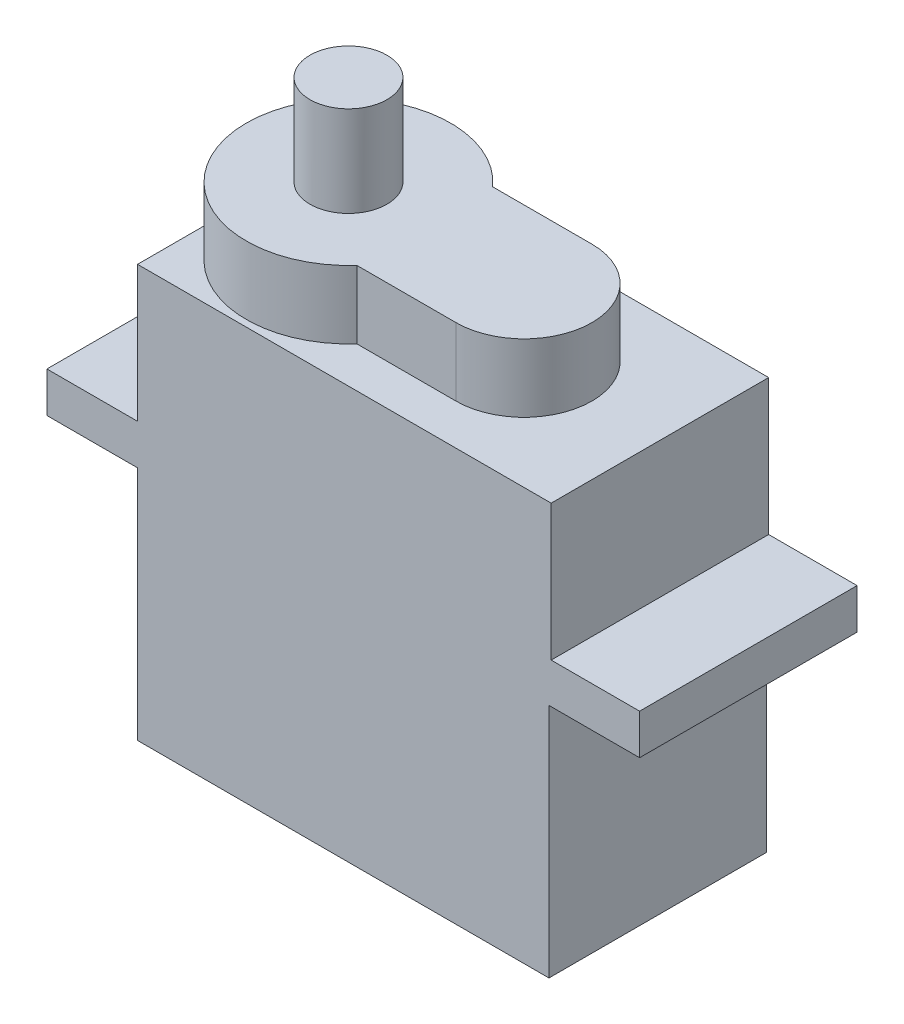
ISO-10303-21;
HEADER;
FILE_DESCRIPTION(('STEP AP214'),'2;1');
FILE_NAME('part.step','',(''),(''),'','','');
FILE_SCHEMA(('AUTOMOTIVE_DESIGN { 1 0 10303 214 1 1 1 1 }'));
ENDSEC;
DATA;
#1=APPLICATION_CONTEXT('core data for automotive mechanical design processes');
#2=APPLICATION_PROTOCOL_DEFINITION('international standard','automotive_design',2000,#1);
#3=PRODUCT_CONTEXT('',#1,'mechanical');
#4=PRODUCT('Part','Part','',(#3));
#5=PRODUCT_RELATED_PRODUCT_CATEGORY('part','',(#4));
#6=PRODUCT_DEFINITION_FORMATION('','',#4);
#7=PRODUCT_DEFINITION_CONTEXT('part definition',#1,'design');
#8=PRODUCT_DEFINITION('design','',#6,#7);
#9=PRODUCT_DEFINITION_SHAPE('','',#8);
#10=(LENGTH_UNIT() NAMED_UNIT(*) SI_UNIT(.MILLI.,.METRE.));
#11=(NAMED_UNIT(*) PLANE_ANGLE_UNIT() SI_UNIT($,.RADIAN.));
#12=(NAMED_UNIT(*) SI_UNIT($,.STERADIAN.) SOLID_ANGLE_UNIT());
#13=UNCERTAINTY_MEASURE_WITH_UNIT(LENGTH_MEASURE(1.E-05),#10,'distance_accuracy_value','');
#14=(GEOMETRIC_REPRESENTATION_CONTEXT(3) GLOBAL_UNCERTAINTY_ASSIGNED_CONTEXT((#13)) GLOBAL_UNIT_ASSIGNED_CONTEXT((#10,
#11,#12)) REPRESENTATION_CONTEXT('',''));
#15=CARTESIAN_POINT('',(0.,0.,0.));
#16=DIRECTION('',(0.,0.,1.));
#17=DIRECTION('',(1.,0.,0.));
#18=AXIS2_PLACEMENT_3D('',#15,#16,#17);
#19=CARTESIAN_POINT('',(-11.5316,9.8806,12.192));
#20=DIRECTION('',(0.,-1.,0.));
#21=DIRECTION('',(0.,0.,-1.));
#22=AXIS2_PLACEMENT_3D('',#19,#20,#21);
#23=PLANE('',#22);
#24=DIRECTION('',(1.,0.,0.));
#25=VECTOR('',#24,1.);
#26=CARTESIAN_POINT('',(4.0347347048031,9.8806,9.906));
#27=LINE('',#26,#25);
#28=CARTESIAN_POINT('',(-1.52716675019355,9.8806,9.906));
#29=VERTEX_POINT('',#28);
#30=CARTESIAN_POINT('',(4.0347347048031,9.8806,9.906));
#31=VERTEX_POINT('',#30);
#32=EDGE_CURVE('E51',#29,#31,#27,.T.);
#33=ORIENTED_EDGE('',*,*,#32,.F.);
#34=CARTESIAN_POINT('',(-5.8039,9.8806,6.096));
#35=DIRECTION('',(0.,1.,0.));
#36=DIRECTION('',(0.,0.,1.));
#37=AXIS2_PLACEMENT_3D('',#34,#35,#36);
#38=CIRCLE('',#37,5.7277);
#39=CARTESIAN_POINT('',(-11.5316,9.8806,6.096));
#40=VERTEX_POINT('',#39);
#41=EDGE_CURVE('E44',#40,#29,#38,.T.);
#42=ORIENTED_EDGE('',*,*,#41,.F.);
#43=DIRECTION('',(0.,0.,-1.));
#44=VECTOR('',#43,1.);
#45=CARTESIAN_POINT('',(-11.5316,9.8806,12.192));
#46=LINE('',#45,#44);
#47=CARTESIAN_POINT('',(-11.5316,9.8806,12.192));
#48=VERTEX_POINT('',#47);
#49=EDGE_CURVE('E229',#48,#40,#46,.T.);
#50=ORIENTED_EDGE('',*,*,#49,.F.);
#51=DIRECTION('',(-1.,0.,0.));
#52=VECTOR('',#51,1.);
#53=CARTESIAN_POINT('',(-11.5316,9.8806,12.192));
#54=LINE('',#53,#52);
#55=CARTESIAN_POINT('',(11.6547347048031,9.8806,12.192));
#56=VERTEX_POINT('',#55);
#57=EDGE_CURVE('E205',#56,#48,#54,.T.);
#58=ORIENTED_EDGE('',*,*,#57,.F.);
#59=DIRECTION('',(0.,0.,-1.));
#60=VECTOR('',#59,1.);
#61=CARTESIAN_POINT('',(11.6547347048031,9.8806,12.192));
#62=LINE('',#61,#60);
#63=CARTESIAN_POINT('',(11.6547347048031,9.8806,0.));
#64=VERTEX_POINT('',#63);
#65=EDGE_CURVE('E232',#56,#64,#62,.T.);
#66=ORIENTED_EDGE('',*,*,#65,.T.);
#67=DIRECTION('',(-1.,0.,0.));
#68=VECTOR('',#67,1.);
#69=CARTESIAN_POINT('',(-11.5316,9.8806,0.));
#70=LINE('',#69,#68);
#71=CARTESIAN_POINT('',(-11.5316,9.8806,0.));
#72=VERTEX_POINT('',#71);
#73=EDGE_CURVE('E185',#64,#72,#70,.T.);
#74=ORIENTED_EDGE('',*,*,#73,.T.);
#75=EDGE_CURVE('E206',#40,#72,#46,.T.);
#76=ORIENTED_EDGE('',*,*,#75,.F.);
#77=CARTESIAN_POINT('',(-1.52716675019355,9.8806,2.286));
#78=VERTEX_POINT('',#77);
#79=EDGE_CURVE('E266',#78,#40,#38,.T.);
#80=ORIENTED_EDGE('',*,*,#79,.F.);
#81=DIRECTION('',(-1.,0.,0.));
#82=VECTOR('',#81,1.);
#83=CARTESIAN_POINT('',(4.0347347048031,9.8806,2.286));
#84=LINE('',#83,#82);
#85=CARTESIAN_POINT('',(4.0347347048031,9.8806,2.286));
#86=VERTEX_POINT('',#85);
#87=EDGE_CURVE('E273',#86,#78,#84,.T.);
#88=ORIENTED_EDGE('',*,*,#87,.F.);
#89=CARTESIAN_POINT('',(4.0347347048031,9.8806,6.096));
#90=DIRECTION('',(0.,1.,0.));
#91=DIRECTION('',(0.,0.,-1.));
#92=AXIS2_PLACEMENT_3D('',#89,#90,#91);
#93=CIRCLE('',#92,3.81);
#94=EDGE_CURVE('E56',#31,#86,#93,.T.);
#95=ORIENTED_EDGE('',*,*,#94,.F.);
#96=EDGE_LOOP('',(#33,#42,#50,#58,#66,#74,#76,#80,#88,#95));
#97=FACE_BOUND('',#96,.T.);
#98=ADVANCED_FACE('F36',(#97),#23,.F.);
#99=CARTESIAN_POINT('',(-11.5316,2.2606,12.192));
#100=DIRECTION('',(1.,0.,0.));
#101=DIRECTION('',(0.,0.,-1.));
#102=AXIS2_PLACEMENT_3D('',#99,#100,#101);
#103=PLANE('',#102);
#104=DIRECTION('',(0.,-1.,0.));
#105=VECTOR('',#104,1.);
#106=CARTESIAN_POINT('',(-11.5316,2.2606,0.));
#107=LINE('',#106,#105);
#108=CARTESIAN_POINT('',(-11.5316,2.2606,0.));
#109=VERTEX_POINT('',#108);
#110=EDGE_CURVE('E172',#72,#109,#107,.T.);
#111=ORIENTED_EDGE('',*,*,#110,.T.);
#112=DIRECTION('',(0.,0.,-1.));
#113=VECTOR('',#112,1.);
#114=CARTESIAN_POINT('',(-11.5316,2.2606,12.192));
#115=LINE('',#114,#113);
#116=CARTESIAN_POINT('',(-11.5316,2.2606,12.192));
#117=VERTEX_POINT('',#116);
#118=EDGE_CURVE('E261',#117,#109,#115,.T.);
#119=ORIENTED_EDGE('',*,*,#118,.F.);
#120=DIRECTION('',(0.,-1.,0.));
#121=VECTOR('',#120,1.);
#122=CARTESIAN_POINT('',(-11.5316,2.2606,12.192));
#123=LINE('',#122,#121);
#124=EDGE_CURVE('E181',#48,#117,#123,.T.);
#125=ORIENTED_EDGE('',*,*,#124,.F.);
#126=ORIENTED_EDGE('',*,*,#49,.T.);
#127=ORIENTED_EDGE('',*,*,#75,.T.);
#128=EDGE_LOOP('',(#111,#119,#125,#126,#127));
#129=FACE_BOUND('',#128,.T.);
#130=ADVANCED_FACE('F38',(#129),#103,.F.);
#131=CARTESIAN_POINT('',(-16.6116,2.2606,12.192));
#132=DIRECTION('',(0.,-1.,0.));
#133=DIRECTION('',(1.,0.,0.));
#134=AXIS2_PLACEMENT_3D('',#131,#132,#133);
#135=PLANE('',#134);
#136=DIRECTION('',(-1.,0.,0.));
#137=VECTOR('',#136,1.);
#138=CARTESIAN_POINT('',(-16.6116,2.2606,0.));
#139=LINE('',#138,#137);
#140=CARTESIAN_POINT('',(-16.6116,2.2606,0.));
#141=VERTEX_POINT('',#140);
#142=EDGE_CURVE('E175',#109,#141,#139,.T.);
#143=ORIENTED_EDGE('',*,*,#142,.T.);
#144=DIRECTION('',(0.,0.,-1.));
#145=VECTOR('',#144,1.);
#146=CARTESIAN_POINT('',(-16.6116,2.2606,12.192));
#147=LINE('',#146,#145);
#148=CARTESIAN_POINT('',(-16.6116,2.2606,12.192));
#149=VERTEX_POINT('',#148);
#150=EDGE_CURVE('E259',#149,#141,#147,.T.);
#151=ORIENTED_EDGE('',*,*,#150,.F.);
#152=DIRECTION('',(-1.,0.,0.));
#153=VECTOR('',#152,1.);
#154=CARTESIAN_POINT('',(-16.6116,2.2606,12.192));
#155=LINE('',#154,#153);
#156=EDGE_CURVE('E184',#117,#149,#155,.T.);
#157=ORIENTED_EDGE('',*,*,#156,.F.);
#158=ORIENTED_EDGE('',*,*,#118,.T.);
#159=EDGE_LOOP('',(#143,#151,#157,#158));
#160=FACE_BOUND('',#159,.T.);
#161=ADVANCED_FACE('F305',(#160),#135,.F.);
#162=CARTESIAN_POINT('',(-16.6116,0.,12.192));
#163=DIRECTION('',(1.,0.,0.));
#164=DIRECTION('',(0.,0.,-1.));
#165=AXIS2_PLACEMENT_3D('',#162,#163,#164);
#166=PLANE('',#165);
#167=DIRECTION('',(0.,-1.,0.));
#168=VECTOR('',#167,1.);
#169=CARTESIAN_POINT('',(-16.6116,0.,0.));
#170=LINE('',#169,#168);
#171=CARTESIAN_POINT('',(-16.6116,0.,0.));
#172=VERTEX_POINT('',#171);
#173=EDGE_CURVE('E209',#141,#172,#170,.T.);
#174=ORIENTED_EDGE('',*,*,#173,.T.);
#175=DIRECTION('',(0.,0.,-1.));
#176=VECTOR('',#175,1.);
#177=CARTESIAN_POINT('',(-16.6116,0.,12.192));
#178=LINE('',#177,#176);
#179=CARTESIAN_POINT('',(-16.6116,0.,12.192));
#180=VERTEX_POINT('',#179);
#181=EDGE_CURVE('E256',#180,#172,#178,.T.);
#182=ORIENTED_EDGE('',*,*,#181,.F.);
#183=DIRECTION('',(0.,-1.,0.));
#184=VECTOR('',#183,1.);
#185=CARTESIAN_POINT('',(-16.6116,0.,12.192));
#186=LINE('',#185,#184);
#187=EDGE_CURVE('E187',#149,#180,#186,.T.);
#188=ORIENTED_EDGE('',*,*,#187,.F.);
#189=ORIENTED_EDGE('',*,*,#150,.T.);
#190=EDGE_LOOP('',(#174,#182,#188,#189));
#191=FACE_BOUND('',#190,.T.);
#192=ADVANCED_FACE('F343',(#191),#166,.F.);
#193=CARTESIAN_POINT('',(-11.5316,0.,12.192));
#194=DIRECTION('',(0.,1.,0.));
#195=DIRECTION('',(-1.,0.,0.));
#196=AXIS2_PLACEMENT_3D('',#193,#194,#195);
#197=PLANE('',#196);
#198=DIRECTION('',(1.,0.,0.));
#199=VECTOR('',#198,1.);
#200=CARTESIAN_POINT('',(-11.5316,0.,0.));
#201=LINE('',#200,#199);
#202=CARTESIAN_POINT('',(-11.5316,0.,0.));
#203=VERTEX_POINT('',#202);
#204=EDGE_CURVE('E211',#172,#203,#201,.T.);
#205=ORIENTED_EDGE('',*,*,#204,.T.);
#206=DIRECTION('',(0.,0.,-1.));
#207=VECTOR('',#206,1.);
#208=CARTESIAN_POINT('',(-11.5316,0.,12.192));
#209=LINE('',#208,#207);
#210=CARTESIAN_POINT('',(-11.5316,0.,12.192));
#211=VERTEX_POINT('',#210);
#212=EDGE_CURVE('E253',#211,#203,#209,.T.);
#213=ORIENTED_EDGE('',*,*,#212,.F.);
#214=DIRECTION('',(1.,0.,0.));
#215=VECTOR('',#214,1.);
#216=CARTESIAN_POINT('',(-11.5316,0.,12.192));
#217=LINE('',#216,#215);
#218=EDGE_CURVE('E189',#180,#211,#217,.T.);
#219=ORIENTED_EDGE('',*,*,#218,.F.);
#220=ORIENTED_EDGE('',*,*,#181,.T.);
#221=EDGE_LOOP('',(#205,#213,#219,#220));
#222=FACE_BOUND('',#221,.T.);
#223=ADVANCED_FACE('F339',(#222),#197,.F.);
#224=CARTESIAN_POINT('',(-11.5316,-13.2334,12.192));
#225=DIRECTION('',(1.,0.,0.));
#226=DIRECTION('',(0.,1.,0.));
#227=AXIS2_PLACEMENT_3D('',#224,#225,#226);
#228=PLANE('',#227);
#229=DIRECTION('',(0.,-1.,0.));
#230=VECTOR('',#229,1.);
#231=CARTESIAN_POINT('',(-11.5316,-13.2334,0.));
#232=LINE('',#231,#230);
#233=CARTESIAN_POINT('',(-11.5316,-13.2334,0.));
#234=VERTEX_POINT('',#233);
#235=EDGE_CURVE('E213',#203,#234,#232,.T.);
#236=ORIENTED_EDGE('',*,*,#235,.T.);
#237=DIRECTION('',(0.,0.,-1.));
#238=VECTOR('',#237,1.);
#239=CARTESIAN_POINT('',(-11.5316,-13.2334,12.192));
#240=LINE('',#239,#238);
#241=CARTESIAN_POINT('',(-11.5316,-13.2334,12.192));
#242=VERTEX_POINT('',#241);
#243=EDGE_CURVE('E250',#242,#234,#240,.T.);
#244=ORIENTED_EDGE('',*,*,#243,.F.);
#245=DIRECTION('',(0.,-1.,0.));
#246=VECTOR('',#245,1.);
#247=CARTESIAN_POINT('',(-11.5316,-13.2334,12.192));
#248=LINE('',#247,#246);
#249=EDGE_CURVE('E191',#211,#242,#248,.T.);
#250=ORIENTED_EDGE('',*,*,#249,.F.);
#251=ORIENTED_EDGE('',*,*,#212,.T.);
#252=EDGE_LOOP('',(#236,#244,#250,#251));
#253=FACE_BOUND('',#252,.T.);
#254=ADVANCED_FACE('F335',(#253),#228,.F.);
#255=CARTESIAN_POINT('',(11.5316,-13.2334,12.192));
#256=DIRECTION('',(0.,1.,0.));
#257=DIRECTION('',(-1.,0.,0.));
#258=AXIS2_PLACEMENT_3D('',#255,#256,#257);
#259=PLANE('',#258);
#260=DIRECTION('',(1.,0.,0.));
#261=VECTOR('',#260,1.);
#262=CARTESIAN_POINT('',(11.5316,-13.2334,0.));
#263=LINE('',#262,#261);
#264=CARTESIAN_POINT('',(11.5316,-13.2334,0.));
#265=VERTEX_POINT('',#264);
#266=EDGE_CURVE('E215',#234,#265,#263,.T.);
#267=ORIENTED_EDGE('',*,*,#266,.T.);
#268=DIRECTION('',(0.,0.,-1.));
#269=VECTOR('',#268,1.);
#270=CARTESIAN_POINT('',(11.5316,-13.2334,12.192));
#271=LINE('',#270,#269);
#272=CARTESIAN_POINT('',(11.5316,-13.2334,12.192));
#273=VERTEX_POINT('',#272);
#274=EDGE_CURVE('E247',#273,#265,#271,.T.);
#275=ORIENTED_EDGE('',*,*,#274,.F.);
#276=DIRECTION('',(1.,0.,0.));
#277=VECTOR('',#276,1.);
#278=CARTESIAN_POINT('',(11.5316,-13.2334,12.192));
#279=LINE('',#278,#277);
#280=EDGE_CURVE('E193',#242,#273,#279,.T.);
#281=ORIENTED_EDGE('',*,*,#280,.F.);
#282=ORIENTED_EDGE('',*,*,#243,.T.);
#283=EDGE_LOOP('',(#267,#275,#281,#282));
#284=FACE_BOUND('',#283,.T.);
#285=ADVANCED_FACE('F331',(#284),#259,.F.);
#286=CARTESIAN_POINT('',(11.5316,0.,12.192));
#287=DIRECTION('',(-1.,0.,0.));
#288=DIRECTION('',(0.,0.,1.));
#289=AXIS2_PLACEMENT_3D('',#286,#287,#288);
#290=PLANE('',#289);
#291=DIRECTION('',(0.,1.,0.));
#292=VECTOR('',#291,1.);
#293=CARTESIAN_POINT('',(11.5316,0.,0.));
#294=LINE('',#293,#292);
#295=CARTESIAN_POINT('',(11.5316,0.,0.));
#296=VERTEX_POINT('',#295);
#297=EDGE_CURVE('E217',#265,#296,#294,.T.);
#298=ORIENTED_EDGE('',*,*,#297,.T.);
#299=DIRECTION('',(0.,0.,-1.));
#300=VECTOR('',#299,1.);
#301=CARTESIAN_POINT('',(11.5316,0.,12.192));
#302=LINE('',#301,#300);
#303=CARTESIAN_POINT('',(11.5316,0.,12.192));
#304=VERTEX_POINT('',#303);
#305=EDGE_CURVE('E244',#304,#296,#302,.T.);
#306=ORIENTED_EDGE('',*,*,#305,.F.);
#307=DIRECTION('',(0.,1.,0.));
#308=VECTOR('',#307,1.);
#309=CARTESIAN_POINT('',(11.5316,0.,12.192));
#310=LINE('',#309,#308);
#311=EDGE_CURVE('E195',#273,#304,#310,.T.);
#312=ORIENTED_EDGE('',*,*,#311,.F.);
#313=ORIENTED_EDGE('',*,*,#274,.T.);
#314=EDGE_LOOP('',(#298,#306,#312,#313));
#315=FACE_BOUND('',#314,.T.);
#316=ADVANCED_FACE('F327',(#315),#290,.F.);
#317=CARTESIAN_POINT('',(16.6116,0.,12.192));
#318=DIRECTION('',(0.,1.,0.));
#319=DIRECTION('',(-1.,0.,0.));
#320=AXIS2_PLACEMENT_3D('',#317,#318,#319);
#321=PLANE('',#320);
#322=DIRECTION('',(1.,0.,0.));
#323=VECTOR('',#322,1.);
#324=CARTESIAN_POINT('',(16.6116,0.,0.));
#325=LINE('',#324,#323);
#326=CARTESIAN_POINT('',(16.6116,0.,0.));
#327=VERTEX_POINT('',#326);
#328=EDGE_CURVE('E219',#296,#327,#325,.T.);
#329=ORIENTED_EDGE('',*,*,#328,.T.);
#330=DIRECTION('',(0.,0.,-1.));
#331=VECTOR('',#330,1.);
#332=CARTESIAN_POINT('',(16.6116,0.,12.192));
#333=LINE('',#332,#331);
#334=CARTESIAN_POINT('',(16.6116,0.,12.192));
#335=VERTEX_POINT('',#334);
#336=EDGE_CURVE('E241',#335,#327,#333,.T.);
#337=ORIENTED_EDGE('',*,*,#336,.F.);
#338=DIRECTION('',(1.,0.,0.));
#339=VECTOR('',#338,1.);
#340=CARTESIAN_POINT('',(16.6116,0.,12.192));
#341=LINE('',#340,#339);
#342=EDGE_CURVE('E197',#304,#335,#341,.T.);
#343=ORIENTED_EDGE('',*,*,#342,.F.);
#344=ORIENTED_EDGE('',*,*,#305,.T.);
#345=EDGE_LOOP('',(#329,#337,#343,#344));
#346=FACE_BOUND('',#345,.T.);
#347=ADVANCED_FACE('F323',(#346),#321,.F.);
#348=CARTESIAN_POINT('',(16.6116,2.2606,12.192));
#349=DIRECTION('',(-1.,0.,0.));
#350=DIRECTION('',(0.,0.,1.));
#351=AXIS2_PLACEMENT_3D('',#348,#349,#350);
#352=PLANE('',#351);
#353=DIRECTION('',(0.,1.,0.));
#354=VECTOR('',#353,1.);
#355=CARTESIAN_POINT('',(16.6116,2.2606,0.));
#356=LINE('',#355,#354);
#357=CARTESIAN_POINT('',(16.6116,2.2606,0.));
#358=VERTEX_POINT('',#357);
#359=EDGE_CURVE('E221',#327,#358,#356,.T.);
#360=ORIENTED_EDGE('',*,*,#359,.T.);
#361=DIRECTION('',(0.,0.,-1.));
#362=VECTOR('',#361,1.);
#363=CARTESIAN_POINT('',(16.6116,2.2606,12.192));
#364=LINE('',#363,#362);
#365=CARTESIAN_POINT('',(16.6116,2.2606,12.192));
#366=VERTEX_POINT('',#365);
#367=EDGE_CURVE('E238',#366,#358,#364,.T.);
#368=ORIENTED_EDGE('',*,*,#367,.F.);
#369=DIRECTION('',(0.,1.,0.));
#370=VECTOR('',#369,1.);
#371=CARTESIAN_POINT('',(16.6116,2.2606,12.192));
#372=LINE('',#371,#370);
#373=EDGE_CURVE('E199',#335,#366,#372,.T.);
#374=ORIENTED_EDGE('',*,*,#373,.F.);
#375=ORIENTED_EDGE('',*,*,#336,.T.);
#376=EDGE_LOOP('',(#360,#368,#374,#375));
#377=FACE_BOUND('',#376,.T.);
#378=ADVANCED_FACE('F319',(#377),#352,.F.);
#379=CARTESIAN_POINT('',(11.6547347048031,2.2606,12.192));
#380=DIRECTION('',(0.,-1.,0.));
#381=DIRECTION('',(1.,0.,0.));
#382=AXIS2_PLACEMENT_3D('',#379,#380,#381);
#383=PLANE('',#382);
#384=DIRECTION('',(-1.,0.,0.));
#385=VECTOR('',#384,1.);
#386=CARTESIAN_POINT('',(11.6547347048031,2.2606,0.));
#387=LINE('',#386,#385);
#388=CARTESIAN_POINT('',(11.6547347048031,2.2606,0.));
#389=VERTEX_POINT('',#388);
#390=EDGE_CURVE('E223',#358,#389,#387,.T.);
#391=ORIENTED_EDGE('',*,*,#390,.T.);
#392=DIRECTION('',(0.,0.,-1.));
#393=VECTOR('',#392,1.);
#394=CARTESIAN_POINT('',(11.6547347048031,2.2606,12.192));
#395=LINE('',#394,#393);
#396=CARTESIAN_POINT('',(11.6547347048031,2.2606,12.192));
#397=VERTEX_POINT('',#396);
#398=EDGE_CURVE('E235',#397,#389,#395,.T.);
#399=ORIENTED_EDGE('',*,*,#398,.F.);
#400=DIRECTION('',(-1.,0.,0.));
#401=VECTOR('',#400,1.);
#402=CARTESIAN_POINT('',(11.6547347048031,2.2606,12.192));
#403=LINE('',#402,#401);
#404=EDGE_CURVE('E201',#366,#397,#403,.T.);
#405=ORIENTED_EDGE('',*,*,#404,.F.);
#406=ORIENTED_EDGE('',*,*,#367,.T.);
#407=EDGE_LOOP('',(#391,#399,#405,#406));
#408=FACE_BOUND('',#407,.T.);
#409=ADVANCED_FACE('F315',(#408),#383,.F.);
#410=CARTESIAN_POINT('',(11.6547347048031,9.8806,12.192));
#411=DIRECTION('',(-1.,0.,0.));
#412=DIRECTION('',(0.,-1.,0.));
#413=AXIS2_PLACEMENT_3D('',#410,#411,#412);
#414=PLANE('',#413);
#415=DIRECTION('',(0.,1.,0.));
#416=VECTOR('',#415,1.);
#417=CARTESIAN_POINT('',(11.6547347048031,9.8806,0.));
#418=LINE('',#417,#416);
#419=EDGE_CURVE('E225',#389,#64,#418,.T.);
#420=ORIENTED_EDGE('',*,*,#419,.T.);
#421=ORIENTED_EDGE('',*,*,#65,.F.);
#422=DIRECTION('',(0.,1.,0.));
#423=VECTOR('',#422,1.);
#424=CARTESIAN_POINT('',(11.6547347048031,9.8806,12.192));
#425=LINE('',#424,#423);
#426=EDGE_CURVE('E203',#397,#56,#425,.T.);
#427=ORIENTED_EDGE('',*,*,#426,.F.);
#428=ORIENTED_EDGE('',*,*,#398,.T.);
#429=EDGE_LOOP('',(#420,#421,#427,#428));
#430=FACE_BOUND('',#429,.T.);
#431=ADVANCED_FACE('F311',(#430),#414,.F.);
#432=CARTESIAN_POINT('',(0.,0.,12.192));
#433=DIRECTION('',(0.,0.,-1.));
#434=DIRECTION('',(-1.,0.,0.));
#435=AXIS2_PLACEMENT_3D('',#432,#433,#434);
#436=PLANE('',#435);
#437=ORIENTED_EDGE('',*,*,#124,.T.);
#438=ORIENTED_EDGE('',*,*,#156,.T.);
#439=ORIENTED_EDGE('',*,*,#187,.T.);
#440=ORIENTED_EDGE('',*,*,#218,.T.);
#441=ORIENTED_EDGE('',*,*,#249,.T.);
#442=ORIENTED_EDGE('',*,*,#280,.T.);
#443=ORIENTED_EDGE('',*,*,#311,.T.);
#444=ORIENTED_EDGE('',*,*,#342,.T.);
#445=ORIENTED_EDGE('',*,*,#373,.T.);
#446=ORIENTED_EDGE('',*,*,#404,.T.);
#447=ORIENTED_EDGE('',*,*,#426,.T.);
#448=ORIENTED_EDGE('',*,*,#57,.T.);
#449=EDGE_LOOP('',(#437,#438,#439,#440,#441,#442,#443,#444,#445,#446,#447,#448));
#450=FACE_BOUND('',#449,.T.);
#451=ADVANCED_FACE('F314',(#450),#436,.F.);
#452=CARTESIAN_POINT('',(0.,0.,0.));
#453=DIRECTION('',(0.,0.,-1.));
#454=DIRECTION('',(-1.,0.,0.));
#455=AXIS2_PLACEMENT_3D('',#452,#453,#454);
#456=PLANE('',#455);
#457=ORIENTED_EDGE('',*,*,#110,.F.);
#458=ORIENTED_EDGE('',*,*,#73,.F.);
#459=ORIENTED_EDGE('',*,*,#419,.F.);
#460=ORIENTED_EDGE('',*,*,#390,.F.);
#461=ORIENTED_EDGE('',*,*,#359,.F.);
#462=ORIENTED_EDGE('',*,*,#328,.F.);
#463=ORIENTED_EDGE('',*,*,#297,.F.);
#464=ORIENTED_EDGE('',*,*,#266,.F.);
#465=ORIENTED_EDGE('',*,*,#235,.F.);
#466=ORIENTED_EDGE('',*,*,#204,.F.);
#467=ORIENTED_EDGE('',*,*,#173,.F.);
#468=ORIENTED_EDGE('',*,*,#142,.F.);
#469=EDGE_LOOP('',(#457,#458,#459,#460,#461,#462,#463,#464,#465,#466,#467,#468));
#470=FACE_BOUND('',#469,.T.);
#471=ADVANCED_FACE('F309',(#470),#456,.T.);
#472=CARTESIAN_POINT('',(4.0347347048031,13.6906,6.096));
#473=DIRECTION('',(0.,-1.,0.));
#474=DIRECTION('',(0.,0.,-1.));
#475=AXIS2_PLACEMENT_3D('',#472,#473,#474);
#476=CYLINDRICAL_SURFACE('',#475,3.81);
#477=ORIENTED_EDGE('',*,*,#94,.T.);
#478=DIRECTION('',(0.,-1.,0.));
#479=VECTOR('',#478,1.);
#480=CARTESIAN_POINT('',(4.0347347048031,13.6906,2.286));
#481=LINE('',#480,#479);
#482=CARTESIAN_POINT('',(4.0347347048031,13.6906,2.286));
#483=VERTEX_POINT('',#482);
#484=EDGE_CURVE('E155',#483,#86,#481,.T.);
#485=ORIENTED_EDGE('',*,*,#484,.F.);
#486=CARTESIAN_POINT('',(4.0347347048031,13.6906,6.096));
#487=DIRECTION('',(0.,1.,0.));
#488=DIRECTION('',(0.,0.,-1.));
#489=AXIS2_PLACEMENT_3D('',#486,#487,#488);
#490=CIRCLE('',#489,3.81);
#491=CARTESIAN_POINT('',(4.0347347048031,13.6906,9.906));
#492=VERTEX_POINT('',#491);
#493=EDGE_CURVE('E161',#492,#483,#490,.T.);
#494=ORIENTED_EDGE('',*,*,#493,.F.);
#495=DIRECTION('',(0.,-1.,0.));
#496=VECTOR('',#495,1.);
#497=CARTESIAN_POINT('',(4.0347347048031,13.6906,9.906));
#498=LINE('',#497,#496);
#499=EDGE_CURVE('E278',#492,#31,#498,.T.);
#500=ORIENTED_EDGE('',*,*,#499,.T.);
#501=EDGE_LOOP('',(#477,#485,#494,#500));
#502=FACE_BOUND('',#501,.T.);
#503=ADVANCED_FACE('F171',(#502),#476,.T.);
#504=CARTESIAN_POINT('',(4.0347347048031,13.6906,2.286));
#505=DIRECTION('',(0.,0.,1.));
#506=DIRECTION('',(1.,0.,0.));
#507=AXIS2_PLACEMENT_3D('',#504,#505,#506);
#508=PLANE('',#507);
#509=ORIENTED_EDGE('',*,*,#87,.T.);
#510=DIRECTION('',(0.,-1.,0.));
#511=VECTOR('',#510,1.);
#512=CARTESIAN_POINT('',(-1.52716675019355,13.6906,2.286));
#513=LINE('',#512,#511);
#514=CARTESIAN_POINT('',(-1.52716675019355,13.6906,2.286));
#515=VERTEX_POINT('',#514);
#516=EDGE_CURVE('E157',#515,#78,#513,.T.);
#517=ORIENTED_EDGE('',*,*,#516,.F.);
#518=DIRECTION('',(-1.,0.,0.));
#519=VECTOR('',#518,1.);
#520=CARTESIAN_POINT('',(4.0347347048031,13.6906,2.286));
#521=LINE('',#520,#519);
#522=EDGE_CURVE('E150',#483,#515,#521,.T.);
#523=ORIENTED_EDGE('',*,*,#522,.F.);
#524=ORIENTED_EDGE('',*,*,#484,.T.);
#525=EDGE_LOOP('',(#509,#517,#523,#524));
#526=FACE_BOUND('',#525,.T.);
#527=ADVANCED_FACE('F153',(#526),#508,.F.);
#528=CARTESIAN_POINT('',(-5.8039,13.6906,6.096));
#529=DIRECTION('',(0.,-1.,0.));
#530=DIRECTION('',(0.,0.,-1.));
#531=AXIS2_PLACEMENT_3D('',#528,#529,#530);
#532=CYLINDRICAL_SURFACE('',#531,5.7277);
#533=ORIENTED_EDGE('',*,*,#79,.T.);
#534=ORIENTED_EDGE('',*,*,#41,.T.);
#535=DIRECTION('',(0.,-1.,0.));
#536=VECTOR('',#535,1.);
#537=CARTESIAN_POINT('',(-1.52716675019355,13.6906,9.906));
#538=LINE('',#537,#536);
#539=CARTESIAN_POINT('',(-1.52716675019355,13.6906,9.906));
#540=VERTEX_POINT('',#539);
#541=EDGE_CURVE('E177',#540,#29,#538,.T.);
#542=ORIENTED_EDGE('',*,*,#541,.F.);
#543=CARTESIAN_POINT('',(-5.8039,13.6906,6.096));
#544=DIRECTION('',(0.,1.,0.));
#545=DIRECTION('',(0.,0.,1.));
#546=AXIS2_PLACEMENT_3D('',#543,#544,#545);
#547=CIRCLE('',#546,5.7277);
#548=EDGE_CURVE('E160',#515,#540,#547,.T.);
#549=ORIENTED_EDGE('',*,*,#548,.F.);
#550=ORIENTED_EDGE('',*,*,#516,.T.);
#551=EDGE_LOOP('',(#533,#534,#542,#549,#550));
#552=FACE_BOUND('',#551,.T.);
#553=ADVANCED_FACE('F297',(#552),#532,.T.);
#554=CARTESIAN_POINT('',(4.0347347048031,13.6906,9.906));
#555=DIRECTION('',(0.,0.,-1.));
#556=DIRECTION('',(-1.,0.,0.));
#557=AXIS2_PLACEMENT_3D('',#554,#555,#556);
#558=PLANE('',#557);
#559=ORIENTED_EDGE('',*,*,#32,.T.);
#560=ORIENTED_EDGE('',*,*,#499,.F.);
#561=DIRECTION('',(1.,0.,0.));
#562=VECTOR('',#561,1.);
#563=CARTESIAN_POINT('',(4.0347347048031,13.6906,9.906));
#564=LINE('',#563,#562);
#565=EDGE_CURVE('E166',#540,#492,#564,.T.);
#566=ORIENTED_EDGE('',*,*,#565,.F.);
#567=ORIENTED_EDGE('',*,*,#541,.T.);
#568=EDGE_LOOP('',(#559,#560,#566,#567));
#569=FACE_BOUND('',#568,.T.);
#570=ADVANCED_FACE('F292',(#569),#558,.F.);
#571=CARTESIAN_POINT('',(4.0347347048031,13.6906,6.096));
#572=DIRECTION('',(0.,-1.,0.));
#573=DIRECTION('',(0.,0.,-1.));
#574=AXIS2_PLACEMENT_3D('',#571,#572,#573);
#575=PLANE('',#574);
#576=CARTESIAN_POINT('',(-5.8039,13.6906,6.096));
#577=DIRECTION('',(0.,-1.,0.));
#578=DIRECTION('',(0.,0.,-1.));
#579=AXIS2_PLACEMENT_3D('',#576,#577,#578);
#580=CIRCLE('',#579,2.159);
#581=CARTESIAN_POINT('',(-5.8039,13.6906,3.937));
#582=VERTEX_POINT('',#581);
#583=EDGE_CURVE('E11',#582,#582,#580,.F.);
#584=ORIENTED_EDGE('',*,*,#583,.F.);
#585=EDGE_LOOP('',(#584));
#586=FACE_BOUND('',#585,.T.);
#587=ORIENTED_EDGE('',*,*,#493,.T.);
#588=ORIENTED_EDGE('',*,*,#522,.T.);
#589=ORIENTED_EDGE('',*,*,#548,.T.);
#590=ORIENTED_EDGE('',*,*,#565,.T.);
#591=EDGE_LOOP('',(#587,#588,#589,#590));
#592=FACE_BOUND('',#591,.T.);
#593=ADVANCED_FACE('F164',(#586,#592),#575,.F.);
#594=CARTESIAN_POINT('',(-5.8039,18.7706,6.096));
#595=DIRECTION('',(0.,-1.,0.));
#596=DIRECTION('',(0.,0.,-1.));
#597=AXIS2_PLACEMENT_3D('',#594,#595,#596);
#598=CYLINDRICAL_SURFACE('',#597,2.159);
#599=CARTESIAN_POINT('',(-5.8039,18.7706,6.096));
#600=DIRECTION('',(0.,1.,0.));
#601=DIRECTION('',(0.,0.,1.));
#602=AXIS2_PLACEMENT_3D('',#599,#600,#601);
#603=CIRCLE('',#602,2.159);
#604=CARTESIAN_POINT('',(-5.8039,18.7706,8.255));
#605=VERTEX_POINT('',#604);
#606=EDGE_CURVE('E274',#605,#605,#603,.T.);
#607=ORIENTED_EDGE('',*,*,#606,.F.);
#608=EDGE_LOOP('',(#607));
#609=FACE_BOUND('',#608,.T.);
#610=ORIENTED_EDGE('',*,*,#583,.T.);
#611=EDGE_LOOP('',(#610));
#612=FACE_BOUND('',#611,.T.);
#613=ADVANCED_FACE('F285',(#609,#612),#598,.T.);
#614=CARTESIAN_POINT('',(-5.8039,18.7706,6.096));
#615=DIRECTION('',(0.,1.,0.));
#616=DIRECTION('',(0.,0.,1.));
#617=AXIS2_PLACEMENT_3D('',#614,#615,#616);
#618=PLANE('',#617);
#619=ORIENTED_EDGE('',*,*,#606,.T.);
#620=EDGE_LOOP('',(#619));
#621=FACE_BOUND('',#620,.T.);
#622=ADVANCED_FACE('F283',(#621),#618,.T.);
#623=CLOSED_SHELL('',(#98,#130,#161,#192,#223,#254,#285,#316,#347,#378,#409,#431,#451,#471,#503,
#527,#553,#570,#593,#613,#622));
#624=MANIFOLD_SOLID_BREP('B2',#623);
#625=ADVANCED_BREP_SHAPE_REPRESENTATION('',(#18,#624),#14);
#626=SHAPE_DEFINITION_REPRESENTATION(#9,#625);
ENDSEC;
END-ISO-10303-21;
